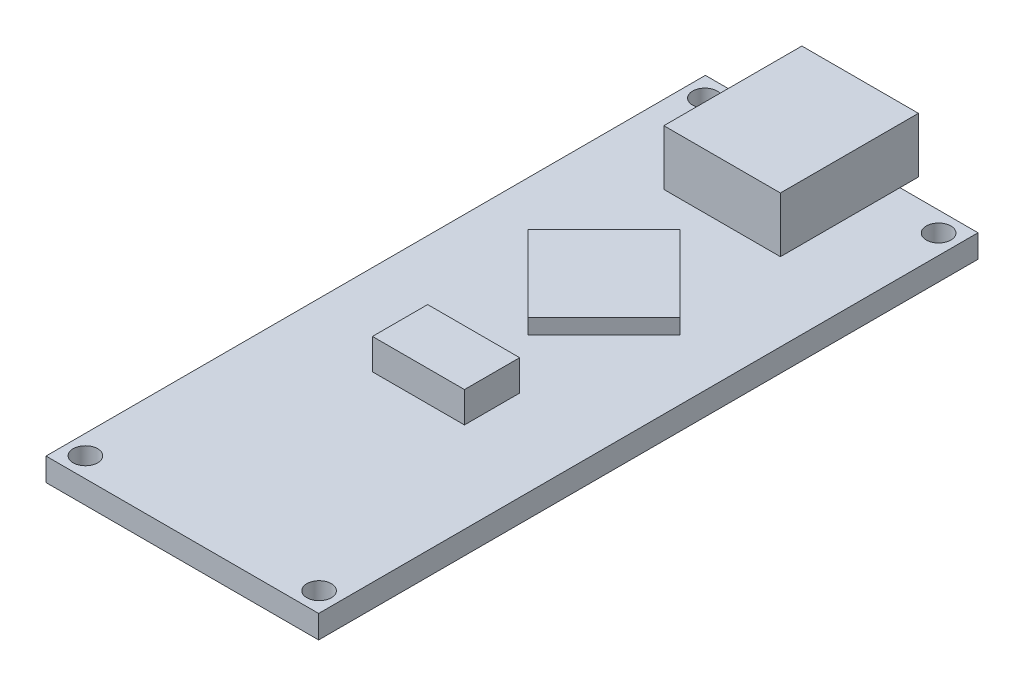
ISO-10303-21;
HEADER;
FILE_DESCRIPTION(('STEP AP214'),'2;1');
FILE_NAME('part.step','',(''),(''),'','','');
FILE_SCHEMA(('AUTOMOTIVE_DESIGN { 1 0 10303 214 1 1 1 1 }'));
ENDSEC;
DATA;
#1=APPLICATION_CONTEXT('core data for automotive mechanical design processes');
#2=APPLICATION_PROTOCOL_DEFINITION('international standard','automotive_design',2000,#1);
#3=PRODUCT_CONTEXT('',#1,'mechanical');
#4=PRODUCT('Part','Part','',(#3));
#5=PRODUCT_RELATED_PRODUCT_CATEGORY('part','',(#4));
#6=PRODUCT_DEFINITION_FORMATION('','',#4);
#7=PRODUCT_DEFINITION_CONTEXT('part definition',#1,'design');
#8=PRODUCT_DEFINITION('design','',#6,#7);
#9=PRODUCT_DEFINITION_SHAPE('','',#8);
#10=(LENGTH_UNIT() NAMED_UNIT(*) SI_UNIT(.MILLI.,.METRE.));
#11=(NAMED_UNIT(*) PLANE_ANGLE_UNIT() SI_UNIT($,.RADIAN.));
#12=(NAMED_UNIT(*) SI_UNIT($,.STERADIAN.) SOLID_ANGLE_UNIT());
#13=UNCERTAINTY_MEASURE_WITH_UNIT(LENGTH_MEASURE(1.E-05),#10,'distance_accuracy_value','');
#14=(GEOMETRIC_REPRESENTATION_CONTEXT(3) GLOBAL_UNCERTAINTY_ASSIGNED_CONTEXT((#13)) GLOBAL_UNIT_ASSIGNED_CONTEXT((#10,
#11,#12)) REPRESENTATION_CONTEXT('',''));
#15=CARTESIAN_POINT('',(0.,0.,0.));
#16=DIRECTION('',(0.,0.,1.));
#17=DIRECTION('',(1.,0.,0.));
#18=AXIS2_PLACEMENT_3D('',#15,#16,#17);
#19=CARTESIAN_POINT('',(0.,0.,0.));
#20=DIRECTION('',(0.,1.,0.));
#21=DIRECTION('',(0.,0.,1.));
#22=AXIS2_PLACEMENT_3D('',#19,#20,#21);
#23=PLANE('',#22);
#24=DIRECTION('',(1.,0.,0.));
#25=VECTOR('',#24,1.);
#26=CARTESIAN_POINT('',(-5.51267828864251,0.,11.7346192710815));
#27=LINE('',#26,#25);
#28=CARTESIAN_POINT('',(-5.51267828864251,0.,11.7346192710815));
#29=VERTEX_POINT('',#28);
#30=CARTESIAN_POINT('',(5.51267828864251,0.,11.7346192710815));
#31=VERTEX_POINT('',#30);
#32=EDGE_CURVE('E227',#29,#31,#27,.T.);
#33=ORIENTED_EDGE('',*,*,#32,.F.);
#34=DIRECTION('',(0.,0.,-1.));
#35=VECTOR('',#34,1.);
#36=CARTESIAN_POINT('',(-5.51267828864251,0.,11.7346192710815));
#37=LINE('',#36,#35);
#38=CARTESIAN_POINT('',(-5.51267828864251,0.,16.0255688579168));
#39=VERTEX_POINT('',#38);
#40=EDGE_CURVE('E240',#39,#29,#37,.T.);
#41=ORIENTED_EDGE('',*,*,#40,.F.);
#42=DIRECTION('',(-1.,0.,0.));
#43=VECTOR('',#42,1.);
#44=CARTESIAN_POINT('',(-5.51267828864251,0.,16.0255688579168));
#45=LINE('',#44,#43);
#46=CARTESIAN_POINT('',(5.51267828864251,0.,16.0255688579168));
#47=VERTEX_POINT('',#46);
#48=EDGE_CURVE('E249',#47,#39,#45,.T.);
#49=ORIENTED_EDGE('',*,*,#48,.F.);
#50=DIRECTION('',(0.,0.,1.));
#51=VECTOR('',#50,1.);
#52=CARTESIAN_POINT('',(5.51267828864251,0.,11.7346192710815));
#53=LINE('',#52,#51);
#54=EDGE_CURVE('E230',#31,#47,#53,.T.);
#55=ORIENTED_EDGE('',*,*,#54,.F.);
#56=EDGE_LOOP('',(#33,#41,#49,#55));
#57=FACE_BOUND('',#56,.T.);
#58=CARTESIAN_POINT('',(-7.62,0.,20.2));
#59=DIRECTION('',(0.,1.,0.));
#60=DIRECTION('',(0.,0.,1.));
#61=AXIS2_PLACEMENT_3D('',#58,#59,#60);
#62=CIRCLE('',#61,0.8);
#63=CARTESIAN_POINT('',(-7.62,0.,21.));
#64=VERTEX_POINT('',#63);
#65=EDGE_CURVE('E371',#64,#64,#62,.T.);
#66=ORIENTED_EDGE('',*,*,#65,.T.);
#67=EDGE_LOOP('',(#66));
#68=FACE_BOUND('',#67,.T.);
#69=CARTESIAN_POINT('',(7.62000000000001,0.,20.2));
#70=DIRECTION('',(0.,1.,0.));
#71=DIRECTION('',(0.,0.,1.));
#72=AXIS2_PLACEMENT_3D('',#69,#70,#71);
#73=CIRCLE('',#72,0.8);
#74=CARTESIAN_POINT('',(7.62000000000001,0.,21.));
#75=VERTEX_POINT('',#74);
#76=EDGE_CURVE('E365',#75,#75,#73,.T.);
#77=ORIENTED_EDGE('',*,*,#76,.T.);
#78=EDGE_LOOP('',(#77));
#79=FACE_BOUND('',#78,.T.);
#80=CARTESIAN_POINT('',(7.61999999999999,0.,-20.2));
#81=DIRECTION('',(0.,1.,0.));
#82=DIRECTION('',(0.,0.,1.));
#83=AXIS2_PLACEMENT_3D('',#80,#81,#82);
#84=CIRCLE('',#83,0.800000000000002);
#85=CARTESIAN_POINT('',(7.61999999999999,0.,-19.4));
#86=VERTEX_POINT('',#85);
#87=EDGE_CURVE('E358',#86,#86,#84,.T.);
#88=ORIENTED_EDGE('',*,*,#87,.T.);
#89=EDGE_LOOP('',(#88));
#90=FACE_BOUND('',#89,.T.);
#91=CARTESIAN_POINT('',(-7.62000000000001,0.,-20.2));
#92=DIRECTION('',(0.,1.,0.));
#93=DIRECTION('',(0.,0.,1.));
#94=AXIS2_PLACEMENT_3D('',#91,#92,#93);
#95=CIRCLE('',#94,0.8);
#96=CARTESIAN_POINT('',(-7.62000000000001,0.,-19.4));
#97=VERTEX_POINT('',#96);
#98=EDGE_CURVE('E376',#97,#97,#95,.T.);
#99=ORIENTED_EDGE('',*,*,#98,.T.);
#100=EDGE_LOOP('',(#99));
#101=FACE_BOUND('',#100,.T.);
#102=DIRECTION('',(1.,0.,0.));
#103=VECTOR('',#102,1.);
#104=CARTESIAN_POINT('',(-8.89,0.,21.5));
#105=LINE('',#104,#103);
#106=CARTESIAN_POINT('',(-8.89,0.,21.5));
#107=VERTEX_POINT('',#106);
#108=CARTESIAN_POINT('',(8.89,0.,21.5));
#109=VERTEX_POINT('',#108);
#110=EDGE_CURVE('E379',#107,#109,#105,.T.);
#111=ORIENTED_EDGE('',*,*,#110,.F.);
#112=DIRECTION('',(0.,0.,1.));
#113=VECTOR('',#112,1.);
#114=CARTESIAN_POINT('',(-8.89,0.,21.5));
#115=LINE('',#114,#113);
#116=CARTESIAN_POINT('',(-8.89,0.,-21.5));
#117=VERTEX_POINT('',#116);
#118=EDGE_CURVE('E386',#117,#107,#115,.T.);
#119=ORIENTED_EDGE('',*,*,#118,.F.);
#120=DIRECTION('',(-1.,0.,0.));
#121=VECTOR('',#120,1.);
#122=CARTESIAN_POINT('',(-8.89,0.,-21.5));
#123=LINE('',#122,#121);
#124=CARTESIAN_POINT('',(8.89,0.,-21.5));
#125=VERTEX_POINT('',#124);
#126=EDGE_CURVE('E400',#125,#117,#123,.T.);
#127=ORIENTED_EDGE('',*,*,#126,.F.);
#128=DIRECTION('',(0.,0.,-1.));
#129=VECTOR('',#128,1.);
#130=CARTESIAN_POINT('',(8.89,0.,21.5));
#131=LINE('',#130,#129);
#132=EDGE_CURVE('E398',#109,#125,#131,.T.);
#133=ORIENTED_EDGE('',*,*,#132,.F.);
#134=EDGE_LOOP('',(#111,#119,#127,#133));
#135=FACE_BOUND('',#134,.T.);
#136=DIRECTION('',(1.,0.,0.));
#137=VECTOR('',#136,1.);
#138=CARTESIAN_POINT('',(-3.36720349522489,0.,-16.3353426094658));
#139=LINE('',#138,#137);
#140=CARTESIAN_POINT('',(-3.36720349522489,0.,-16.3353426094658));
#141=VERTEX_POINT('',#140);
#142=CARTESIAN_POINT('',(3.36720349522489,0.,-16.3353426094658));
#143=VERTEX_POINT('',#142);
#144=EDGE_CURVE('E226',#141,#143,#139,.T.);
#145=ORIENTED_EDGE('',*,*,#144,.F.);
#146=DIRECTION('',(0.,0.,-1.));
#147=VECTOR('',#146,1.);
#148=CARTESIAN_POINT('',(-3.36720349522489,0.,-16.3353426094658));
#149=LINE('',#148,#147);
#150=CARTESIAN_POINT('',(-3.36720349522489,0.,-3.58168689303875));
#151=VERTEX_POINT('',#150);
#152=EDGE_CURVE('E223',#151,#141,#149,.T.);
#153=ORIENTED_EDGE('',*,*,#152,.F.);
#154=DIRECTION('',(-1.,0.,0.));
#155=VECTOR('',#154,1.);
#156=CARTESIAN_POINT('',(-3.36720349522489,0.,-3.58168689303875));
#157=LINE('',#156,#155);
#158=CARTESIAN_POINT('',(3.36720349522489,0.,-3.58168689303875));
#159=VERTEX_POINT('',#158);
#160=EDGE_CURVE('E59',#159,#151,#157,.T.);
#161=ORIENTED_EDGE('',*,*,#160,.F.);
#162=DIRECTION('',(0.,0.,1.));
#163=VECTOR('',#162,1.);
#164=CARTESIAN_POINT('',(3.36720349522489,0.,-16.3353426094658));
#165=LINE('',#164,#163);
#166=EDGE_CURVE('E54',#143,#159,#165,.T.);
#167=ORIENTED_EDGE('',*,*,#166,.F.);
#168=EDGE_LOOP('',(#145,#153,#161,#167));
#169=FACE_BOUND('',#168,.T.);
#170=ADVANCED_FACE('F39',(#57,#68,#79,#90,#101,#135,#169),#23,.F.);
#171=CARTESIAN_POINT('',(0.,1.5,0.));
#172=DIRECTION('',(0.,1.,0.));
#173=DIRECTION('',(0.,0.,1.));
#174=AXIS2_PLACEMENT_3D('',#171,#172,#173);
#175=PLANE('',#174);
#176=CARTESIAN_POINT('',(-7.62,1.5,20.2));
#177=DIRECTION('',(0.,1.,0.));
#178=DIRECTION('',(0.,0.,1.));
#179=AXIS2_PLACEMENT_3D('',#176,#177,#178);
#180=CIRCLE('',#179,0.8);
#181=CARTESIAN_POINT('',(-7.62,1.5,21.));
#182=VERTEX_POINT('',#181);
#183=EDGE_CURVE('E357',#182,#182,#180,.T.);
#184=ORIENTED_EDGE('',*,*,#183,.F.);
#185=EDGE_LOOP('',(#184));
#186=FACE_BOUND('',#185,.T.);
#187=CARTESIAN_POINT('',(7.62000000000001,1.5,20.2));
#188=DIRECTION('',(0.,1.,0.));
#189=DIRECTION('',(0.,0.,1.));
#190=AXIS2_PLACEMENT_3D('',#187,#188,#189);
#191=CIRCLE('',#190,0.8);
#192=CARTESIAN_POINT('',(7.62000000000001,1.5,21.));
#193=VERTEX_POINT('',#192);
#194=EDGE_CURVE('E368',#193,#193,#191,.T.);
#195=ORIENTED_EDGE('',*,*,#194,.F.);
#196=EDGE_LOOP('',(#195));
#197=FACE_BOUND('',#196,.T.);
#198=CARTESIAN_POINT('',(7.61999999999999,1.5,-20.2));
#199=DIRECTION('',(0.,1.,0.));
#200=DIRECTION('',(0.,0.,1.));
#201=AXIS2_PLACEMENT_3D('',#198,#199,#200);
#202=CIRCLE('',#201,0.800000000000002);
#203=CARTESIAN_POINT('',(7.61999999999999,1.5,-19.4));
#204=VERTEX_POINT('',#203);
#205=EDGE_CURVE('E362',#204,#204,#202,.T.);
#206=ORIENTED_EDGE('',*,*,#205,.F.);
#207=EDGE_LOOP('',(#206));
#208=FACE_BOUND('',#207,.T.);
#209=CARTESIAN_POINT('',(-7.62000000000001,1.5,-20.2));
#210=DIRECTION('',(0.,1.,0.));
#211=DIRECTION('',(0.,0.,1.));
#212=AXIS2_PLACEMENT_3D('',#209,#210,#211);
#213=CIRCLE('',#212,0.8);
#214=CARTESIAN_POINT('',(-7.62000000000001,1.5,-19.4));
#215=VERTEX_POINT('',#214);
#216=EDGE_CURVE('E361',#215,#215,#213,.T.);
#217=ORIENTED_EDGE('',*,*,#216,.F.);
#218=EDGE_LOOP('',(#217));
#219=FACE_BOUND('',#218,.T.);
#220=DIRECTION('',(0.707106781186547,0.,-0.707106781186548));
#221=VECTOR('',#220,1.);
#222=CARTESIAN_POINT('',(0.,1.5,-1.05025253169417));
#223=LINE('',#222,#221);
#224=CARTESIAN_POINT('',(0.,1.5,-1.05025253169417));
#225=VERTEX_POINT('',#224);
#226=CARTESIAN_POINT('',(4.94974746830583,1.5,-6.));
#227=VERTEX_POINT('',#226);
#228=EDGE_CURVE('E342',#225,#227,#223,.T.);
#229=ORIENTED_EDGE('',*,*,#228,.F.);
#230=DIRECTION('',(0.707106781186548,0.,0.707106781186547));
#231=VECTOR('',#230,1.);
#232=CARTESIAN_POINT('',(-4.94974746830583,1.5,-6.));
#233=LINE('',#232,#231);
#234=CARTESIAN_POINT('',(-4.94974746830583,1.5,-6.));
#235=VERTEX_POINT('',#234);
#236=EDGE_CURVE('E328',#235,#225,#233,.T.);
#237=ORIENTED_EDGE('',*,*,#236,.F.);
#238=DIRECTION('',(-0.707106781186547,0.,0.707106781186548));
#239=VECTOR('',#238,1.);
#240=CARTESIAN_POINT('',(-4.94974746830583,1.5,-6.));
#241=LINE('',#240,#239);
#242=CARTESIAN_POINT('',(0.,1.5,-10.9497474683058));
#243=VERTEX_POINT('',#242);
#244=EDGE_CURVE('E333',#243,#235,#241,.T.);
#245=ORIENTED_EDGE('',*,*,#244,.F.);
#246=DIRECTION('',(-0.707106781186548,0.,-0.707106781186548));
#247=VECTOR('',#246,1.);
#248=CARTESIAN_POINT('',(0.,1.5,-10.9497474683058));
#249=LINE('',#248,#247);
#250=EDGE_CURVE('E344',#227,#243,#249,.T.);
#251=ORIENTED_EDGE('',*,*,#250,.F.);
#252=EDGE_LOOP('',(#229,#237,#245,#251));
#253=FACE_BOUND('',#252,.T.);
#254=DIRECTION('',(-1.,0.,0.));
#255=VECTOR('',#254,1.);
#256=CARTESIAN_POINT('',(-8.89,1.5,-21.5));
#257=LINE('',#256,#255);
#258=CARTESIAN_POINT('',(8.89,1.5,-21.5));
#259=VERTEX_POINT('',#258);
#260=CARTESIAN_POINT('',(3.79999999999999,1.5,-21.5));
#261=VERTEX_POINT('',#260);
#262=EDGE_CURVE('E389',#259,#261,#257,.T.);
#263=ORIENTED_EDGE('',*,*,#262,.T.);
#264=DIRECTION('',(0.,0.,-1.));
#265=VECTOR('',#264,1.);
#266=CARTESIAN_POINT('',(3.8,1.5,-13.7037215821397));
#267=LINE('',#266,#265);
#268=CARTESIAN_POINT('',(3.8,1.5,-13.7037215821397));
#269=VERTEX_POINT('',#268);
#270=EDGE_CURVE('E309',#269,#261,#267,.T.);
#271=ORIENTED_EDGE('',*,*,#270,.F.);
#272=DIRECTION('',(1.,0.,0.));
#273=VECTOR('',#272,1.);
#274=CARTESIAN_POINT('',(-3.8,1.5,-13.7037215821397));
#275=LINE('',#274,#273);
#276=CARTESIAN_POINT('',(-3.8,1.5,-13.7037215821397));
#277=VERTEX_POINT('',#276);
#278=EDGE_CURVE('E294',#277,#269,#275,.T.);
#279=ORIENTED_EDGE('',*,*,#278,.F.);
#280=DIRECTION('',(0.,0.,1.));
#281=VECTOR('',#280,1.);
#282=CARTESIAN_POINT('',(-3.8,1.5,-13.7037215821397));
#283=LINE('',#282,#281);
#284=CARTESIAN_POINT('',(-3.8,1.5,-21.5));
#285=VERTEX_POINT('',#284);
#286=EDGE_CURVE('E314',#285,#277,#283,.T.);
#287=ORIENTED_EDGE('',*,*,#286,.F.);
#288=CARTESIAN_POINT('',(-8.89,1.5,-21.5));
#289=VERTEX_POINT('',#288);
#290=EDGE_CURVE('E388',#285,#289,#257,.T.);
#291=ORIENTED_EDGE('',*,*,#290,.T.);
#292=DIRECTION('',(0.,0.,1.));
#293=VECTOR('',#292,1.);
#294=CARTESIAN_POINT('',(-8.89,1.5,21.5));
#295=LINE('',#294,#293);
#296=CARTESIAN_POINT('',(-8.89,1.5,21.5));
#297=VERTEX_POINT('',#296);
#298=EDGE_CURVE('E392',#289,#297,#295,.T.);
#299=ORIENTED_EDGE('',*,*,#298,.T.);
#300=DIRECTION('',(1.,0.,0.));
#301=VECTOR('',#300,1.);
#302=CARTESIAN_POINT('',(-8.89,1.5,21.5));
#303=LINE('',#302,#301);
#304=CARTESIAN_POINT('',(8.89,1.5,21.5));
#305=VERTEX_POINT('',#304);
#306=EDGE_CURVE('E382',#297,#305,#303,.T.);
#307=ORIENTED_EDGE('',*,*,#306,.T.);
#308=DIRECTION('',(0.,0.,-1.));
#309=VECTOR('',#308,1.);
#310=CARTESIAN_POINT('',(8.89,1.5,21.5));
#311=LINE('',#310,#309);
#312=EDGE_CURVE('E385',#305,#259,#311,.T.);
#313=ORIENTED_EDGE('',*,*,#312,.T.);
#314=EDGE_LOOP('',(#263,#271,#279,#287,#291,#299,#307,#313));
#315=FACE_BOUND('',#314,.T.);
#316=DIRECTION('',(0.,0.,-1.));
#317=VECTOR('',#316,1.);
#318=CARTESIAN_POINT('',(3.,1.5,6.1));
#319=LINE('',#318,#317);
#320=CARTESIAN_POINT('',(3.,1.5,6.1));
#321=VERTEX_POINT('',#320);
#322=CARTESIAN_POINT('',(3.,1.5,2.5));
#323=VERTEX_POINT('',#322);
#324=EDGE_CURVE('E279',#321,#323,#319,.T.);
#325=ORIENTED_EDGE('',*,*,#324,.F.);
#326=DIRECTION('',(1.,0.,0.));
#327=VECTOR('',#326,1.);
#328=CARTESIAN_POINT('',(-3.,1.5,6.1));
#329=LINE('',#328,#327);
#330=CARTESIAN_POINT('',(-3.,1.5,6.1));
#331=VERTEX_POINT('',#330);
#332=EDGE_CURVE('E265',#331,#321,#329,.T.);
#333=ORIENTED_EDGE('',*,*,#332,.F.);
#334=DIRECTION('',(0.,0.,1.));
#335=VECTOR('',#334,1.);
#336=CARTESIAN_POINT('',(-3.,1.5,6.1));
#337=LINE('',#336,#335);
#338=CARTESIAN_POINT('',(-3.,1.5,2.5));
#339=VERTEX_POINT('',#338);
#340=EDGE_CURVE('E270',#339,#331,#337,.T.);
#341=ORIENTED_EDGE('',*,*,#340,.F.);
#342=DIRECTION('',(-1.,0.,0.));
#343=VECTOR('',#342,1.);
#344=CARTESIAN_POINT('',(-3.,1.5,2.5));
#345=LINE('',#344,#343);
#346=EDGE_CURVE('E281',#323,#339,#345,.T.);
#347=ORIENTED_EDGE('',*,*,#346,.F.);
#348=EDGE_LOOP('',(#325,#333,#341,#347));
#349=FACE_BOUND('',#348,.T.);
#350=ADVANCED_FACE('F426',(#186,#197,#208,#219,#253,#315,#349),#175,.T.);
#351=CARTESIAN_POINT('',(-8.89,1.5,21.5));
#352=DIRECTION('',(0.,0.,-1.));
#353=DIRECTION('',(-1.,0.,0.));
#354=AXIS2_PLACEMENT_3D('',#351,#352,#353);
#355=PLANE('',#354);
#356=ORIENTED_EDGE('',*,*,#110,.T.);
#357=DIRECTION('',(0.,-1.,0.));
#358=VECTOR('',#357,1.);
#359=CARTESIAN_POINT('',(8.89,1.5,21.5));
#360=LINE('',#359,#358);
#361=EDGE_CURVE('E11',#305,#109,#360,.T.);
#362=ORIENTED_EDGE('',*,*,#361,.F.);
#363=ORIENTED_EDGE('',*,*,#306,.F.);
#364=DIRECTION('',(0.,-1.,0.));
#365=VECTOR('',#364,1.);
#366=CARTESIAN_POINT('',(-8.89,1.5,21.5));
#367=LINE('',#366,#365);
#368=EDGE_CURVE('E395',#297,#107,#367,.T.);
#369=ORIENTED_EDGE('',*,*,#368,.T.);
#370=EDGE_LOOP('',(#356,#362,#363,#369));
#371=FACE_BOUND('',#370,.T.);
#372=ADVANCED_FACE('F41',(#371),#355,.F.);
#373=CARTESIAN_POINT('',(8.89,1.5,21.5));
#374=DIRECTION('',(-1.,0.,0.));
#375=DIRECTION('',(0.,0.,1.));
#376=AXIS2_PLACEMENT_3D('',#373,#374,#375);
#377=PLANE('',#376);
#378=ORIENTED_EDGE('',*,*,#132,.T.);
#379=DIRECTION('',(0.,-1.,0.));
#380=VECTOR('',#379,1.);
#381=CARTESIAN_POINT('',(8.89,1.5,-21.5));
#382=LINE('',#381,#380);
#383=EDGE_CURVE('E47',#259,#125,#382,.T.);
#384=ORIENTED_EDGE('',*,*,#383,.F.);
#385=ORIENTED_EDGE('',*,*,#312,.F.);
#386=ORIENTED_EDGE('',*,*,#361,.T.);
#387=EDGE_LOOP('',(#378,#384,#385,#386));
#388=FACE_BOUND('',#387,.T.);
#389=ADVANCED_FACE('F480',(#388),#377,.F.);
#390=CARTESIAN_POINT('',(-8.89,1.5,-21.5));
#391=DIRECTION('',(0.,0.,1.));
#392=DIRECTION('',(1.,0.,0.));
#393=AXIS2_PLACEMENT_3D('',#390,#391,#392);
#394=PLANE('',#393);
#395=ORIENTED_EDGE('',*,*,#126,.T.);
#396=DIRECTION('',(0.,-1.,0.));
#397=VECTOR('',#396,1.);
#398=CARTESIAN_POINT('',(-8.89,1.5,-21.5));
#399=LINE('',#398,#397);
#400=EDGE_CURVE('E405',#289,#117,#399,.T.);
#401=ORIENTED_EDGE('',*,*,#400,.F.);
#402=ORIENTED_EDGE('',*,*,#290,.F.);
#403=EDGE_CURVE('E393',#261,#285,#257,.T.);
#404=ORIENTED_EDGE('',*,*,#403,.F.);
#405=ORIENTED_EDGE('',*,*,#262,.F.);
#406=ORIENTED_EDGE('',*,*,#383,.T.);
#407=EDGE_LOOP('',(#395,#401,#402,#404,#405,#406));
#408=FACE_BOUND('',#407,.T.);
#409=ADVANCED_FACE('F412',(#408),#394,.F.);
#410=CARTESIAN_POINT('',(-8.89,1.5,21.5));
#411=DIRECTION('',(1.,0.,0.));
#412=DIRECTION('',(0.,0.,-1.));
#413=AXIS2_PLACEMENT_3D('',#410,#411,#412);
#414=PLANE('',#413);
#415=ORIENTED_EDGE('',*,*,#118,.T.);
#416=ORIENTED_EDGE('',*,*,#368,.F.);
#417=ORIENTED_EDGE('',*,*,#298,.F.);
#418=ORIENTED_EDGE('',*,*,#400,.T.);
#419=EDGE_LOOP('',(#415,#416,#417,#418));
#420=FACE_BOUND('',#419,.T.);
#421=ADVANCED_FACE('F420',(#420),#414,.F.);
#422=CARTESIAN_POINT('',(-7.62000000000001,0.,-20.2));
#423=DIRECTION('',(0.,1.,0.));
#424=DIRECTION('',(0.,0.,1.));
#425=AXIS2_PLACEMENT_3D('',#422,#423,#424);
#426=CYLINDRICAL_SURFACE('',#425,0.8);
#427=ORIENTED_EDGE('',*,*,#98,.F.);
#428=EDGE_LOOP('',(#427));
#429=FACE_BOUND('',#428,.T.);
#430=ORIENTED_EDGE('',*,*,#216,.T.);
#431=EDGE_LOOP('',(#430));
#432=FACE_BOUND('',#431,.T.);
#433=ADVANCED_FACE('F478',(#429,#432),#426,.F.);
#434=CARTESIAN_POINT('',(7.61999999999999,0.,-20.2));
#435=DIRECTION('',(0.,1.,0.));
#436=DIRECTION('',(0.,0.,1.));
#437=AXIS2_PLACEMENT_3D('',#434,#435,#436);
#438=CYLINDRICAL_SURFACE('',#437,0.800000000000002);
#439=ORIENTED_EDGE('',*,*,#87,.F.);
#440=EDGE_LOOP('',(#439));
#441=FACE_BOUND('',#440,.T.);
#442=ORIENTED_EDGE('',*,*,#205,.T.);
#443=EDGE_LOOP('',(#442));
#444=FACE_BOUND('',#443,.T.);
#445=ADVANCED_FACE('F782',(#441,#444),#438,.F.);
#446=CARTESIAN_POINT('',(7.62000000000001,0.,20.2));
#447=DIRECTION('',(0.,1.,0.));
#448=DIRECTION('',(0.,0.,1.));
#449=AXIS2_PLACEMENT_3D('',#446,#447,#448);
#450=CYLINDRICAL_SURFACE('',#449,0.8);
#451=ORIENTED_EDGE('',*,*,#76,.F.);
#452=EDGE_LOOP('',(#451));
#453=FACE_BOUND('',#452,.T.);
#454=ORIENTED_EDGE('',*,*,#194,.T.);
#455=EDGE_LOOP('',(#454));
#456=FACE_BOUND('',#455,.T.);
#457=ADVANCED_FACE('F772',(#453,#456),#450,.F.);
#458=CARTESIAN_POINT('',(-7.62,0.,20.2));
#459=DIRECTION('',(0.,1.,0.));
#460=DIRECTION('',(0.,0.,1.));
#461=AXIS2_PLACEMENT_3D('',#458,#459,#460);
#462=CYLINDRICAL_SURFACE('',#461,0.8);
#463=ORIENTED_EDGE('',*,*,#65,.F.);
#464=EDGE_LOOP('',(#463));
#465=FACE_BOUND('',#464,.T.);
#466=ORIENTED_EDGE('',*,*,#183,.T.);
#467=EDGE_LOOP('',(#466));
#468=FACE_BOUND('',#467,.T.);
#469=ADVANCED_FACE('F762',(#465,#468),#462,.F.);
#470=CARTESIAN_POINT('',(-4.94974746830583,2.5,-6.));
#471=DIRECTION('',(0.707106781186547,0.,-0.707106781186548));
#472=DIRECTION('',(-0.707106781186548,0.,-0.707106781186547));
#473=AXIS2_PLACEMENT_3D('',#470,#471,#472);
#474=PLANE('',#473);
#475=ORIENTED_EDGE('',*,*,#236,.T.);
#476=DIRECTION('',(0.,-1.,0.));
#477=VECTOR('',#476,1.);
#478=CARTESIAN_POINT('',(0.,2.5,-1.05025253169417));
#479=LINE('',#478,#477);
#480=CARTESIAN_POINT('',(0.,2.5,-1.05025253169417));
#481=VERTEX_POINT('',#480);
#482=EDGE_CURVE('E355',#481,#225,#479,.T.);
#483=ORIENTED_EDGE('',*,*,#482,.F.);
#484=DIRECTION('',(0.707106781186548,0.,0.707106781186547));
#485=VECTOR('',#484,1.);
#486=CARTESIAN_POINT('',(-4.94974746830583,2.5,-6.));
#487=LINE('',#486,#485);
#488=CARTESIAN_POINT('',(-4.94974746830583,2.5,-6.));
#489=VERTEX_POINT('',#488);
#490=EDGE_CURVE('E329',#489,#481,#487,.T.);
#491=ORIENTED_EDGE('',*,*,#490,.F.);
#492=DIRECTION('',(0.,-1.,0.));
#493=VECTOR('',#492,1.);
#494=CARTESIAN_POINT('',(-4.94974746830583,2.5,-6.));
#495=LINE('',#494,#493);
#496=EDGE_CURVE('E339',#489,#235,#495,.T.);
#497=ORIENTED_EDGE('',*,*,#496,.T.);
#498=EDGE_LOOP('',(#475,#483,#491,#497));
#499=FACE_BOUND('',#498,.T.);
#500=ADVANCED_FACE('F752',(#499),#474,.F.);
#501=CARTESIAN_POINT('',(0.,2.5,-1.05025253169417));
#502=DIRECTION('',(-0.707106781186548,0.,-0.707106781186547));
#503=DIRECTION('',(-0.707106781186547,0.,0.707106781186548));
#504=AXIS2_PLACEMENT_3D('',#501,#502,#503);
#505=PLANE('',#504);
#506=ORIENTED_EDGE('',*,*,#228,.T.);
#507=DIRECTION('',(0.,-1.,0.));
#508=VECTOR('',#507,1.);
#509=CARTESIAN_POINT('',(4.94974746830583,2.5,-6.));
#510=LINE('',#509,#508);
#511=CARTESIAN_POINT('',(4.94974746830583,2.5,-6.));
#512=VERTEX_POINT('',#511);
#513=EDGE_CURVE('E352',#512,#227,#510,.T.);
#514=ORIENTED_EDGE('',*,*,#513,.F.);
#515=DIRECTION('',(0.707106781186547,0.,-0.707106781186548));
#516=VECTOR('',#515,1.);
#517=CARTESIAN_POINT('',(0.,2.5,-1.05025253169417));
#518=LINE('',#517,#516);
#519=EDGE_CURVE('E332',#481,#512,#518,.T.);
#520=ORIENTED_EDGE('',*,*,#519,.F.);
#521=ORIENTED_EDGE('',*,*,#482,.T.);
#522=EDGE_LOOP('',(#506,#514,#520,#521));
#523=FACE_BOUND('',#522,.T.);
#524=ADVANCED_FACE('F742',(#523),#505,.F.);
#525=CARTESIAN_POINT('',(0.,2.5,-10.9497474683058));
#526=DIRECTION('',(-0.707106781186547,0.,0.707106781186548));
#527=DIRECTION('',(0.707106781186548,0.,0.707106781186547));
#528=AXIS2_PLACEMENT_3D('',#525,#526,#527);
#529=PLANE('',#528);
#530=ORIENTED_EDGE('',*,*,#250,.T.);
#531=DIRECTION('',(0.,-1.,0.));
#532=VECTOR('',#531,1.);
#533=CARTESIAN_POINT('',(0.,2.5,-10.9497474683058));
#534=LINE('',#533,#532);
#535=CARTESIAN_POINT('',(0.,2.5,-10.9497474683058));
#536=VERTEX_POINT('',#535);
#537=EDGE_CURVE('E350',#536,#243,#534,.T.);
#538=ORIENTED_EDGE('',*,*,#537,.F.);
#539=DIRECTION('',(-0.707106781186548,0.,-0.707106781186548));
#540=VECTOR('',#539,1.);
#541=CARTESIAN_POINT('',(0.,2.5,-10.9497474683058));
#542=LINE('',#541,#540);
#543=EDGE_CURVE('E335',#512,#536,#542,.T.);
#544=ORIENTED_EDGE('',*,*,#543,.F.);
#545=ORIENTED_EDGE('',*,*,#513,.T.);
#546=EDGE_LOOP('',(#530,#538,#544,#545));
#547=FACE_BOUND('',#546,.T.);
#548=ADVANCED_FACE('F732',(#547),#529,.F.);
#549=CARTESIAN_POINT('',(-4.94974746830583,2.5,-6.));
#550=DIRECTION('',(0.707106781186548,0.,0.707106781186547));
#551=DIRECTION('',(0.707106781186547,0.,-0.707106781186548));
#552=AXIS2_PLACEMENT_3D('',#549,#550,#551);
#553=PLANE('',#552);
#554=ORIENTED_EDGE('',*,*,#244,.T.);
#555=ORIENTED_EDGE('',*,*,#496,.F.);
#556=DIRECTION('',(-0.707106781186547,0.,0.707106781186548));
#557=VECTOR('',#556,1.);
#558=CARTESIAN_POINT('',(-4.94974746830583,2.5,-6.));
#559=LINE('',#558,#557);
#560=EDGE_CURVE('E337',#536,#489,#559,.T.);
#561=ORIENTED_EDGE('',*,*,#560,.F.);
#562=ORIENTED_EDGE('',*,*,#537,.T.);
#563=EDGE_LOOP('',(#554,#555,#561,#562));
#564=FACE_BOUND('',#563,.T.);
#565=ADVANCED_FACE('F722',(#564),#553,.F.);
#566=CARTESIAN_POINT('',(0.,2.5,0.));
#567=DIRECTION('',(0.,1.,0.));
#568=DIRECTION('',(0.,0.,1.));
#569=AXIS2_PLACEMENT_3D('',#566,#567,#568);
#570=PLANE('',#569);
#571=ORIENTED_EDGE('',*,*,#490,.T.);
#572=ORIENTED_EDGE('',*,*,#519,.T.);
#573=ORIENTED_EDGE('',*,*,#543,.T.);
#574=ORIENTED_EDGE('',*,*,#560,.T.);
#575=EDGE_LOOP('',(#571,#572,#573,#574));
#576=FACE_BOUND('',#575,.T.);
#577=ADVANCED_FACE('F706',(#576),#570,.T.);
#578=CARTESIAN_POINT('',(0.,1.5,0.));
#579=DIRECTION('',(0.,1.,0.));
#580=DIRECTION('',(0.,0.,1.));
#581=AXIS2_PLACEMENT_3D('',#578,#579,#580);
#582=PLANE('',#581);
#583=CARTESIAN_POINT('',(3.8,1.5,-22.7037215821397));
#584=VERTEX_POINT('',#583);
#585=EDGE_CURVE('E308',#261,#584,#267,.T.);
#586=ORIENTED_EDGE('',*,*,#585,.F.);
#587=ORIENTED_EDGE('',*,*,#403,.T.);
#588=CARTESIAN_POINT('',(-3.8,1.5,-22.7037215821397));
#589=VERTEX_POINT('',#588);
#590=EDGE_CURVE('E299',#589,#285,#283,.T.);
#591=ORIENTED_EDGE('',*,*,#590,.F.);
#592=DIRECTION('',(-1.,0.,0.));
#593=VECTOR('',#592,1.);
#594=CARTESIAN_POINT('',(-3.8,1.5,-22.7037215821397));
#595=LINE('',#594,#593);
#596=EDGE_CURVE('E312',#584,#589,#595,.T.);
#597=ORIENTED_EDGE('',*,*,#596,.F.);
#598=EDGE_LOOP('',(#586,#587,#591,#597));
#599=FACE_BOUND('',#598,.T.);
#600=ADVANCED_FACE('F434',(#599),#582,.F.);
#601=CARTESIAN_POINT('',(-3.8,5.1,-13.7037215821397));
#602=DIRECTION('',(0.,0.,-1.));
#603=DIRECTION('',(-1.,0.,0.));
#604=AXIS2_PLACEMENT_3D('',#601,#602,#603);
#605=PLANE('',#604);
#606=ORIENTED_EDGE('',*,*,#278,.T.);
#607=DIRECTION('',(0.,-1.,0.));
#608=VECTOR('',#607,1.);
#609=CARTESIAN_POINT('',(3.8,5.1,-13.7037215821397));
#610=LINE('',#609,#608);
#611=CARTESIAN_POINT('',(3.8,5.1,-13.7037215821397));
#612=VERTEX_POINT('',#611);
#613=EDGE_CURVE('E325',#612,#269,#610,.T.);
#614=ORIENTED_EDGE('',*,*,#613,.F.);
#615=DIRECTION('',(1.,0.,0.));
#616=VECTOR('',#615,1.);
#617=CARTESIAN_POINT('',(-3.8,5.1,-13.7037215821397));
#618=LINE('',#617,#616);
#619=CARTESIAN_POINT('',(-3.8,5.1,-13.7037215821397));
#620=VERTEX_POINT('',#619);
#621=EDGE_CURVE('E295',#620,#612,#618,.T.);
#622=ORIENTED_EDGE('',*,*,#621,.F.);
#623=DIRECTION('',(0.,-1.,0.));
#624=VECTOR('',#623,1.);
#625=CARTESIAN_POINT('',(-3.8,5.1,-13.7037215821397));
#626=LINE('',#625,#624);
#627=EDGE_CURVE('E305',#620,#277,#626,.T.);
#628=ORIENTED_EDGE('',*,*,#627,.T.);
#629=EDGE_LOOP('',(#606,#614,#622,#628));
#630=FACE_BOUND('',#629,.T.);
#631=ADVANCED_FACE('F449',(#630),#605,.F.);
#632=CARTESIAN_POINT('',(3.8,5.1,-13.7037215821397));
#633=DIRECTION('',(-1.,0.,0.));
#634=DIRECTION('',(0.,0.,1.));
#635=AXIS2_PLACEMENT_3D('',#632,#633,#634);
#636=PLANE('',#635);
#637=ORIENTED_EDGE('',*,*,#270,.T.);
#638=ORIENTED_EDGE('',*,*,#585,.T.);
#639=DIRECTION('',(0.,-1.,0.));
#640=VECTOR('',#639,1.);
#641=CARTESIAN_POINT('',(3.8,5.1,-22.7037215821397));
#642=LINE('',#641,#640);
#643=CARTESIAN_POINT('',(3.8,5.1,-22.7037215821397));
#644=VERTEX_POINT('',#643);
#645=EDGE_CURVE('E322',#644,#584,#642,.T.);
#646=ORIENTED_EDGE('',*,*,#645,.F.);
#647=DIRECTION('',(0.,0.,-1.));
#648=VECTOR('',#647,1.);
#649=CARTESIAN_POINT('',(3.8,5.1,-13.7037215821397));
#650=LINE('',#649,#648);
#651=EDGE_CURVE('E298',#612,#644,#650,.T.);
#652=ORIENTED_EDGE('',*,*,#651,.F.);
#653=ORIENTED_EDGE('',*,*,#613,.T.);
#654=EDGE_LOOP('',(#637,#638,#646,#652,#653));
#655=FACE_BOUND('',#654,.T.);
#656=ADVANCED_FACE('F446',(#655),#636,.F.);
#657=CARTESIAN_POINT('',(-3.8,5.1,-22.7037215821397));
#658=DIRECTION('',(0.,0.,1.));
#659=DIRECTION('',(1.,0.,0.));
#660=AXIS2_PLACEMENT_3D('',#657,#658,#659);
#661=PLANE('',#660);
#662=ORIENTED_EDGE('',*,*,#596,.T.);
#663=DIRECTION('',(0.,-1.,0.));
#664=VECTOR('',#663,1.);
#665=CARTESIAN_POINT('',(-3.8,5.1,-22.7037215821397));
#666=LINE('',#665,#664);
#667=CARTESIAN_POINT('',(-3.8,5.1,-22.7037215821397));
#668=VERTEX_POINT('',#667);
#669=EDGE_CURVE('E319',#668,#589,#666,.T.);
#670=ORIENTED_EDGE('',*,*,#669,.F.);
#671=DIRECTION('',(-1.,0.,0.));
#672=VECTOR('',#671,1.);
#673=CARTESIAN_POINT('',(-3.8,5.1,-22.7037215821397));
#674=LINE('',#673,#672);
#675=EDGE_CURVE('E301',#644,#668,#674,.T.);
#676=ORIENTED_EDGE('',*,*,#675,.F.);
#677=ORIENTED_EDGE('',*,*,#645,.T.);
#678=EDGE_LOOP('',(#662,#670,#676,#677));
#679=FACE_BOUND('',#678,.T.);
#680=ADVANCED_FACE('F443',(#679),#661,.F.);
#681=CARTESIAN_POINT('',(-3.8,5.1,-13.7037215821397));
#682=DIRECTION('',(1.,0.,0.));
#683=DIRECTION('',(0.,0.,-1.));
#684=AXIS2_PLACEMENT_3D('',#681,#682,#683);
#685=PLANE('',#684);
#686=ORIENTED_EDGE('',*,*,#590,.T.);
#687=ORIENTED_EDGE('',*,*,#286,.T.);
#688=ORIENTED_EDGE('',*,*,#627,.F.);
#689=DIRECTION('',(0.,0.,1.));
#690=VECTOR('',#689,1.);
#691=CARTESIAN_POINT('',(-3.8,5.1,-13.7037215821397));
#692=LINE('',#691,#690);
#693=EDGE_CURVE('E303',#668,#620,#692,.T.);
#694=ORIENTED_EDGE('',*,*,#693,.F.);
#695=ORIENTED_EDGE('',*,*,#669,.T.);
#696=EDGE_LOOP('',(#686,#687,#688,#694,#695));
#697=FACE_BOUND('',#696,.T.);
#698=ADVANCED_FACE('F437',(#697),#685,.F.);
#699=CARTESIAN_POINT('',(0.,5.1,0.));
#700=DIRECTION('',(0.,1.,0.));
#701=DIRECTION('',(0.,0.,1.));
#702=AXIS2_PLACEMENT_3D('',#699,#700,#701);
#703=PLANE('',#702);
#704=ORIENTED_EDGE('',*,*,#621,.T.);
#705=ORIENTED_EDGE('',*,*,#651,.T.);
#706=ORIENTED_EDGE('',*,*,#675,.T.);
#707=ORIENTED_EDGE('',*,*,#693,.T.);
#708=EDGE_LOOP('',(#704,#705,#706,#707));
#709=FACE_BOUND('',#708,.T.);
#710=ADVANCED_FACE('F452',(#709),#703,.T.);
#711=CARTESIAN_POINT('',(-3.,3.5,6.1));
#712=DIRECTION('',(0.,0.,-1.));
#713=DIRECTION('',(-1.,0.,0.));
#714=AXIS2_PLACEMENT_3D('',#711,#712,#713);
#715=PLANE('',#714);
#716=ORIENTED_EDGE('',*,*,#332,.T.);
#717=DIRECTION('',(0.,-1.,0.));
#718=VECTOR('',#717,1.);
#719=CARTESIAN_POINT('',(3.,3.5,6.1));
#720=LINE('',#719,#718);
#721=CARTESIAN_POINT('',(3.,3.5,6.1));
#722=VERTEX_POINT('',#721);
#723=EDGE_CURVE('E292',#722,#321,#720,.T.);
#724=ORIENTED_EDGE('',*,*,#723,.F.);
#725=DIRECTION('',(1.,0.,0.));
#726=VECTOR('',#725,1.);
#727=CARTESIAN_POINT('',(-3.,3.5,6.1));
#728=LINE('',#727,#726);
#729=CARTESIAN_POINT('',(-3.,3.5,6.1));
#730=VERTEX_POINT('',#729);
#731=EDGE_CURVE('E266',#730,#722,#728,.T.);
#732=ORIENTED_EDGE('',*,*,#731,.F.);
#733=DIRECTION('',(0.,-1.,0.));
#734=VECTOR('',#733,1.);
#735=CARTESIAN_POINT('',(-3.,3.5,6.1));
#736=LINE('',#735,#734);
#737=EDGE_CURVE('E276',#730,#331,#736,.T.);
#738=ORIENTED_EDGE('',*,*,#737,.T.);
#739=EDGE_LOOP('',(#716,#724,#732,#738));
#740=FACE_BOUND('',#739,.T.);
#741=ADVANCED_FACE('F454',(#740),#715,.F.);
#742=CARTESIAN_POINT('',(3.,3.5,6.1));
#743=DIRECTION('',(-1.,0.,0.));
#744=DIRECTION('',(0.,0.,1.));
#745=AXIS2_PLACEMENT_3D('',#742,#743,#744);
#746=PLANE('',#745);
#747=ORIENTED_EDGE('',*,*,#324,.T.);
#748=DIRECTION('',(0.,-1.,0.));
#749=VECTOR('',#748,1.);
#750=CARTESIAN_POINT('',(3.,3.5,2.5));
#751=LINE('',#750,#749);
#752=CARTESIAN_POINT('',(3.,3.5,2.5));
#753=VERTEX_POINT('',#752);
#754=EDGE_CURVE('E289',#753,#323,#751,.T.);
#755=ORIENTED_EDGE('',*,*,#754,.F.);
#756=DIRECTION('',(0.,0.,-1.));
#757=VECTOR('',#756,1.);
#758=CARTESIAN_POINT('',(3.,3.5,6.1));
#759=LINE('',#758,#757);
#760=EDGE_CURVE('E269',#722,#753,#759,.T.);
#761=ORIENTED_EDGE('',*,*,#760,.F.);
#762=ORIENTED_EDGE('',*,*,#723,.T.);
#763=EDGE_LOOP('',(#747,#755,#761,#762));
#764=FACE_BOUND('',#763,.T.);
#765=ADVANCED_FACE('F460',(#764),#746,.F.);
#766=CARTESIAN_POINT('',(-3.,3.5,2.5));
#767=DIRECTION('',(0.,0.,1.));
#768=DIRECTION('',(1.,0.,0.));
#769=AXIS2_PLACEMENT_3D('',#766,#767,#768);
#770=PLANE('',#769);
#771=ORIENTED_EDGE('',*,*,#346,.T.);
#772=DIRECTION('',(0.,-1.,0.));
#773=VECTOR('',#772,1.);
#774=CARTESIAN_POINT('',(-3.,3.5,2.5));
#775=LINE('',#774,#773);
#776=CARTESIAN_POINT('',(-3.,3.5,2.5));
#777=VERTEX_POINT('',#776);
#778=EDGE_CURVE('E287',#777,#339,#775,.T.);
#779=ORIENTED_EDGE('',*,*,#778,.F.);
#780=DIRECTION('',(-1.,0.,0.));
#781=VECTOR('',#780,1.);
#782=CARTESIAN_POINT('',(-3.,3.5,2.5));
#783=LINE('',#782,#781);
#784=EDGE_CURVE('E272',#753,#777,#783,.T.);
#785=ORIENTED_EDGE('',*,*,#784,.F.);
#786=ORIENTED_EDGE('',*,*,#754,.T.);
#787=EDGE_LOOP('',(#771,#779,#785,#786));
#788=FACE_BOUND('',#787,.T.);
#789=ADVANCED_FACE('F509',(#788),#770,.F.);
#790=CARTESIAN_POINT('',(-3.,3.5,6.1));
#791=DIRECTION('',(1.,0.,0.));
#792=DIRECTION('',(0.,0.,-1.));
#793=AXIS2_PLACEMENT_3D('',#790,#791,#792);
#794=PLANE('',#793);
#795=ORIENTED_EDGE('',*,*,#340,.T.);
#796=ORIENTED_EDGE('',*,*,#737,.F.);
#797=DIRECTION('',(0.,0.,1.));
#798=VECTOR('',#797,1.);
#799=CARTESIAN_POINT('',(-3.,3.5,6.1));
#800=LINE('',#799,#798);
#801=EDGE_CURVE('E274',#777,#730,#800,.T.);
#802=ORIENTED_EDGE('',*,*,#801,.F.);
#803=ORIENTED_EDGE('',*,*,#778,.T.);
#804=EDGE_LOOP('',(#795,#796,#802,#803));
#805=FACE_BOUND('',#804,.T.);
#806=ADVANCED_FACE('F519',(#805),#794,.F.);
#807=CARTESIAN_POINT('',(0.,3.5,0.));
#808=DIRECTION('',(0.,1.,0.));
#809=DIRECTION('',(0.,0.,1.));
#810=AXIS2_PLACEMENT_3D('',#807,#808,#809);
#811=PLANE('',#810);
#812=ORIENTED_EDGE('',*,*,#731,.T.);
#813=ORIENTED_EDGE('',*,*,#760,.T.);
#814=ORIENTED_EDGE('',*,*,#784,.T.);
#815=ORIENTED_EDGE('',*,*,#801,.T.);
#816=EDGE_LOOP('',(#812,#813,#814,#815));
#817=FACE_BOUND('',#816,.T.);
#818=ADVANCED_FACE('F529',(#817),#811,.T.);
#819=CARTESIAN_POINT('',(-5.51267828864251,-1.,11.7346192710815));
#820=DIRECTION('',(0.,0.,1.));
#821=DIRECTION('',(1.,0.,0.));
#822=AXIS2_PLACEMENT_3D('',#819,#820,#821);
#823=PLANE('',#822);
#824=ORIENTED_EDGE('',*,*,#32,.T.);
#825=DIRECTION('',(0.,1.,0.));
#826=VECTOR('',#825,1.);
#827=CARTESIAN_POINT('',(5.51267828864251,-1.,11.7346192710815));
#828=LINE('',#827,#826);
#829=CARTESIAN_POINT('',(5.51267828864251,-1.,11.7346192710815));
#830=VERTEX_POINT('',#829);
#831=EDGE_CURVE('E262',#830,#31,#828,.T.);
#832=ORIENTED_EDGE('',*,*,#831,.F.);
#833=DIRECTION('',(1.,0.,0.));
#834=VECTOR('',#833,1.);
#835=CARTESIAN_POINT('',(-5.51267828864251,-1.,11.7346192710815));
#836=LINE('',#835,#834);
#837=CARTESIAN_POINT('',(-5.51267828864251,-1.,11.7346192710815));
#838=VERTEX_POINT('',#837);
#839=EDGE_CURVE('E236',#838,#830,#836,.T.);
#840=ORIENTED_EDGE('',*,*,#839,.F.);
#841=DIRECTION('',(0.,1.,0.));
#842=VECTOR('',#841,1.);
#843=CARTESIAN_POINT('',(-5.51267828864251,-1.,11.7346192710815));
#844=LINE('',#843,#842);
#845=EDGE_CURVE('E245',#838,#29,#844,.T.);
#846=ORIENTED_EDGE('',*,*,#845,.T.);
#847=EDGE_LOOP('',(#824,#832,#840,#846));
#848=FACE_BOUND('',#847,.T.);
#849=ADVANCED_FACE('F539',(#848),#823,.F.);
#850=CARTESIAN_POINT('',(5.51267828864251,-1.,11.7346192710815));
#851=DIRECTION('',(-1.,0.,0.));
#852=DIRECTION('',(0.,0.,1.));
#853=AXIS2_PLACEMENT_3D('',#850,#851,#852);
#854=PLANE('',#853);
#855=ORIENTED_EDGE('',*,*,#54,.T.);
#856=DIRECTION('',(0.,1.,0.));
#857=VECTOR('',#856,1.);
#858=CARTESIAN_POINT('',(5.51267828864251,-1.,16.0255688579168));
#859=LINE('',#858,#857);
#860=CARTESIAN_POINT('',(5.51267828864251,-1.,16.0255688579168));
#861=VERTEX_POINT('',#860);
#862=EDGE_CURVE('E259',#861,#47,#859,.T.);
#863=ORIENTED_EDGE('',*,*,#862,.F.);
#864=DIRECTION('',(0.,0.,1.));
#865=VECTOR('',#864,1.);
#866=CARTESIAN_POINT('',(5.51267828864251,-1.,11.7346192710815));
#867=LINE('',#866,#865);
#868=EDGE_CURVE('E239',#830,#861,#867,.T.);
#869=ORIENTED_EDGE('',*,*,#868,.F.);
#870=ORIENTED_EDGE('',*,*,#831,.T.);
#871=EDGE_LOOP('',(#855,#863,#869,#870));
#872=FACE_BOUND('',#871,.T.);
#873=ADVANCED_FACE('F549',(#872),#854,.F.);
#874=CARTESIAN_POINT('',(-5.51267828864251,-1.,16.0255688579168));
#875=DIRECTION('',(0.,0.,-1.));
#876=DIRECTION('',(-1.,0.,0.));
#877=AXIS2_PLACEMENT_3D('',#874,#875,#876);
#878=PLANE('',#877);
#879=ORIENTED_EDGE('',*,*,#48,.T.);
#880=DIRECTION('',(0.,1.,0.));
#881=VECTOR('',#880,1.);
#882=CARTESIAN_POINT('',(-5.51267828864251,-1.,16.0255688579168));
#883=LINE('',#882,#881);
#884=CARTESIAN_POINT('',(-5.51267828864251,-1.,16.0255688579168));
#885=VERTEX_POINT('',#884);
#886=EDGE_CURVE('E256',#885,#39,#883,.T.);
#887=ORIENTED_EDGE('',*,*,#886,.F.);
#888=DIRECTION('',(-1.,0.,0.));
#889=VECTOR('',#888,1.);
#890=CARTESIAN_POINT('',(-5.51267828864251,-1.,16.0255688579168));
#891=LINE('',#890,#889);
#892=EDGE_CURVE('E242',#861,#885,#891,.T.);
#893=ORIENTED_EDGE('',*,*,#892,.F.);
#894=ORIENTED_EDGE('',*,*,#862,.T.);
#895=EDGE_LOOP('',(#879,#887,#893,#894));
#896=FACE_BOUND('',#895,.T.);
#897=ADVANCED_FACE('F559',(#896),#878,.F.);
#898=CARTESIAN_POINT('',(-5.51267828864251,-1.,11.7346192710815));
#899=DIRECTION('',(1.,0.,0.));
#900=DIRECTION('',(0.,0.,-1.));
#901=AXIS2_PLACEMENT_3D('',#898,#899,#900);
#902=PLANE('',#901);
#903=ORIENTED_EDGE('',*,*,#40,.T.);
#904=ORIENTED_EDGE('',*,*,#845,.F.);
#905=DIRECTION('',(0.,0.,-1.));
#906=VECTOR('',#905,1.);
#907=CARTESIAN_POINT('',(-5.51267828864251,-1.,11.7346192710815));
#908=LINE('',#907,#906);
#909=EDGE_CURVE('E244',#885,#838,#908,.T.);
#910=ORIENTED_EDGE('',*,*,#909,.F.);
#911=ORIENTED_EDGE('',*,*,#886,.T.);
#912=EDGE_LOOP('',(#903,#904,#910,#911));
#913=FACE_BOUND('',#912,.T.);
#914=ADVANCED_FACE('F569',(#913),#902,.F.);
#915=CARTESIAN_POINT('',(0.,-1.,0.));
#916=DIRECTION('',(0.,-1.,0.));
#917=DIRECTION('',(0.,0.,-1.));
#918=AXIS2_PLACEMENT_3D('',#915,#916,#917);
#919=PLANE('',#918);
#920=ORIENTED_EDGE('',*,*,#839,.T.);
#921=ORIENTED_EDGE('',*,*,#868,.T.);
#922=ORIENTED_EDGE('',*,*,#892,.T.);
#923=ORIENTED_EDGE('',*,*,#909,.T.);
#924=EDGE_LOOP('',(#920,#921,#922,#923));
#925=FACE_BOUND('',#924,.T.);
#926=ADVANCED_FACE('F579',(#925),#919,.T.);
#927=CARTESIAN_POINT('',(-3.36720349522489,-1.,-16.3353426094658));
#928=DIRECTION('',(0.,0.,1.));
#929=DIRECTION('',(1.,0.,0.));
#930=AXIS2_PLACEMENT_3D('',#927,#928,#929);
#931=PLANE('',#930);
#932=ORIENTED_EDGE('',*,*,#144,.T.);
#933=DIRECTION('',(0.,1.,0.));
#934=VECTOR('',#933,1.);
#935=CARTESIAN_POINT('',(3.36720349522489,-1.,-16.3353426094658));
#936=LINE('',#935,#934);
#937=CARTESIAN_POINT('',(3.36720349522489,-1.,-16.3353426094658));
#938=VERTEX_POINT('',#937);
#939=EDGE_CURVE('E207',#938,#143,#936,.T.);
#940=ORIENTED_EDGE('',*,*,#939,.F.);
#941=DIRECTION('',(1.,0.,0.));
#942=VECTOR('',#941,1.);
#943=CARTESIAN_POINT('',(-3.36720349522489,-1.,-16.3353426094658));
#944=LINE('',#943,#942);
#945=CARTESIAN_POINT('',(-3.36720349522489,-1.,-16.3353426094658));
#946=VERTEX_POINT('',#945);
#947=EDGE_CURVE('E214',#946,#938,#944,.T.);
#948=ORIENTED_EDGE('',*,*,#947,.F.);
#949=DIRECTION('',(0.,1.,0.));
#950=VECTOR('',#949,1.);
#951=CARTESIAN_POINT('',(-3.36720349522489,-1.,-16.3353426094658));
#952=LINE('',#951,#950);
#953=EDGE_CURVE('E643',#946,#141,#952,.T.);
#954=ORIENTED_EDGE('',*,*,#953,.T.);
#955=EDGE_LOOP('',(#932,#940,#948,#954));
#956=FACE_BOUND('',#955,.T.);
#957=ADVANCED_FACE('F225',(#956),#931,.F.);
#958=CARTESIAN_POINT('',(3.36720349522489,-1.,-16.3353426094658));
#959=DIRECTION('',(-1.,0.,0.));
#960=DIRECTION('',(0.,0.,1.));
#961=AXIS2_PLACEMENT_3D('',#958,#959,#960);
#962=PLANE('',#961);
#963=ORIENTED_EDGE('',*,*,#166,.T.);
#964=DIRECTION('',(0.,1.,0.));
#965=VECTOR('',#964,1.);
#966=CARTESIAN_POINT('',(3.36720349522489,-1.,-3.58168689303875));
#967=LINE('',#966,#965);
#968=CARTESIAN_POINT('',(3.36720349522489,-1.,-3.58168689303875));
#969=VERTEX_POINT('',#968);
#970=EDGE_CURVE('E210',#969,#159,#967,.T.);
#971=ORIENTED_EDGE('',*,*,#970,.F.);
#972=DIRECTION('',(0.,0.,1.));
#973=VECTOR('',#972,1.);
#974=CARTESIAN_POINT('',(3.36720349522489,-1.,-16.3353426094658));
#975=LINE('',#974,#973);
#976=EDGE_CURVE('E203',#938,#969,#975,.T.);
#977=ORIENTED_EDGE('',*,*,#976,.F.);
#978=ORIENTED_EDGE('',*,*,#939,.T.);
#979=EDGE_LOOP('',(#963,#971,#977,#978));
#980=FACE_BOUND('',#979,.T.);
#981=ADVANCED_FACE('F205',(#980),#962,.F.);
#982=CARTESIAN_POINT('',(-3.36720349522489,-1.,-3.58168689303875));
#983=DIRECTION('',(0.,0.,-1.));
#984=DIRECTION('',(-1.,0.,0.));
#985=AXIS2_PLACEMENT_3D('',#982,#983,#984);
#986=PLANE('',#985);
#987=ORIENTED_EDGE('',*,*,#160,.T.);
#988=DIRECTION('',(0.,1.,0.));
#989=VECTOR('',#988,1.);
#990=CARTESIAN_POINT('',(-3.36720349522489,-1.,-3.58168689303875));
#991=LINE('',#990,#989);
#992=CARTESIAN_POINT('',(-3.36720349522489,-1.,-3.58168689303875));
#993=VERTEX_POINT('',#992);
#994=EDGE_CURVE('E232',#993,#151,#991,.T.);
#995=ORIENTED_EDGE('',*,*,#994,.F.);
#996=DIRECTION('',(-1.,0.,0.));
#997=VECTOR('',#996,1.);
#998=CARTESIAN_POINT('',(-3.36720349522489,-1.,-3.58168689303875));
#999=LINE('',#998,#997);
#1000=EDGE_CURVE('E213',#969,#993,#999,.T.);
#1001=ORIENTED_EDGE('',*,*,#1000,.F.);
#1002=ORIENTED_EDGE('',*,*,#970,.T.);
#1003=EDGE_LOOP('',(#987,#995,#1001,#1002));
#1004=FACE_BOUND('',#1003,.T.);
#1005=ADVANCED_FACE('F610',(#1004),#986,.F.);
#1006=CARTESIAN_POINT('',(-3.36720349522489,-1.,-16.3353426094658));
#1007=DIRECTION('',(1.,0.,0.));
#1008=DIRECTION('',(0.,0.,-1.));
#1009=AXIS2_PLACEMENT_3D('',#1006,#1007,#1008);
#1010=PLANE('',#1009);
#1011=ORIENTED_EDGE('',*,*,#152,.T.);
#1012=ORIENTED_EDGE('',*,*,#953,.F.);
#1013=DIRECTION('',(0.,0.,-1.));
#1014=VECTOR('',#1013,1.);
#1015=CARTESIAN_POINT('',(-3.36720349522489,-1.,-16.3353426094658));
#1016=LINE('',#1015,#1014);
#1017=EDGE_CURVE('E219',#993,#946,#1016,.T.);
#1018=ORIENTED_EDGE('',*,*,#1017,.F.);
#1019=ORIENTED_EDGE('',*,*,#994,.T.);
#1020=EDGE_LOOP('',(#1011,#1012,#1018,#1019));
#1021=FACE_BOUND('',#1020,.T.);
#1022=ADVANCED_FACE('F619',(#1021),#1010,.F.);
#1023=CARTESIAN_POINT('',(0.,-1.,0.));
#1024=DIRECTION('',(0.,-1.,0.));
#1025=DIRECTION('',(0.,0.,-1.));
#1026=AXIS2_PLACEMENT_3D('',#1023,#1024,#1025);
#1027=PLANE('',#1026);
#1028=ORIENTED_EDGE('',*,*,#947,.T.);
#1029=ORIENTED_EDGE('',*,*,#976,.T.);
#1030=ORIENTED_EDGE('',*,*,#1000,.T.);
#1031=ORIENTED_EDGE('',*,*,#1017,.T.);
#1032=EDGE_LOOP('',(#1028,#1029,#1030,#1031));
#1033=FACE_BOUND('',#1032,.T.);
#1034=ADVANCED_FACE('F217',(#1033),#1027,.T.);
#1035=CLOSED_SHELL('',(#170,#350,#372,#389,#409,#421,#433,#445,#457,#469,#500,#524,#548,#565,
#577,#600,#631,#656,#680,#698,#710,#741,#765,#789,#806,#818,#849,#873,#897,#914,#926,#957,#981,
#1005,#1022,#1034));
#1036=MANIFOLD_SOLID_BREP('B2',#1035);
#1037=ADVANCED_BREP_SHAPE_REPRESENTATION('',(#18,#1036),#14);
#1038=SHAPE_DEFINITION_REPRESENTATION(#9,#1037);
ENDSEC;
END-ISO-10303-21;
